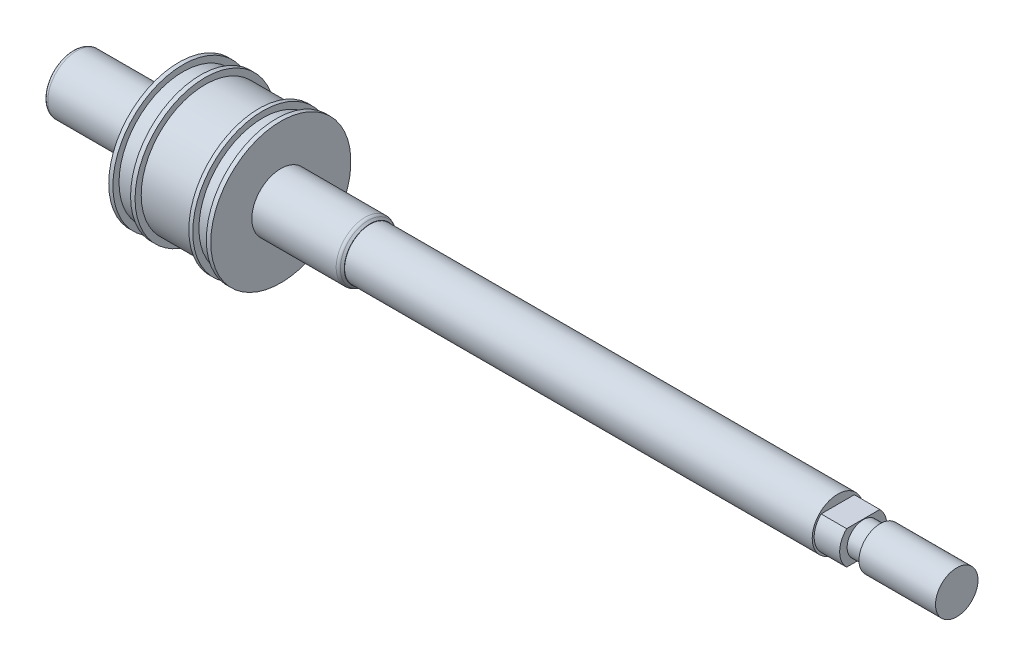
from build123d import *

# Parameters (mm, degrees)
SKETCH1_R      = 6
EXTRUDE1_DEPTH = 180
EXTRUDE2_DEPTH = 6
SKETCH3_R      = 3.788307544
EXTRUDE3_DEPTH = 4
SKETCH4_R      = 5
EXTRUDE4_DEPTH = 18
SKETCH8_R      = 6.825455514
EXTRUDE5_DEPTH = 70
CHAMFER1_SIZE  = 0.75
FILLET1_R      = 1
FILLET2_R      = 1
SKETCH9_R      = 16.479367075
EXTRUDE6_DEPTH = 24
SKETCH10_W     = 4.15677911
SKETCH10_H     = 1.813063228
SKETCH10_W_2   = 12.647221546
SKETCH10_W_3   = 3.183915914


with BuildPart() as part:
    # Sketch1 → Extrude1 (new body)
    with BuildSketch(Plane(origin=(0, 0, 0), x_dir=(0, 0, -1), z_dir=(1, 0, 0))):
        with Locations(Location((0, 0, 0), (0, 0, 180))):
            Circle(SKETCH1_R)
    extrude(amount=EXTRUDE1_DEPTH)

    # Sketch2 → Extrude2 (add)
    with BuildSketch(Plane(origin=(180, 0, 0), x_dir=(0, 0, -1), z_dir=(1, 0, 0))):
        with BuildLine():
            Line((-3.906170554, 3.923966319), (3.906170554, 3.923966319))
            ThreePointArc((3.906170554, 3.923966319), (5.53675718, 0), (3.906170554, -3.923966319))
            Line((3.906170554, -3.923966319), (-3.906170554, -3.923966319))
            ThreePointArc((-3.906170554, -3.923966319), (-5.53675718, 0), (-3.906170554, 3.923966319))
        make_face()
    extrude(amount=EXTRUDE2_DEPTH)

    # Sketch3 → Extrude3 (add)
    with BuildSketch(Plane(origin=(186, 0, 0), x_dir=(0, 0, -1), z_dir=(1, 0, 0))):
        Circle(SKETCH3_R)
    extrude(amount=EXTRUDE3_DEPTH)

    # Sketch4 → Extrude4 (add)
    with BuildSketch(Plane(origin=(190, 0, 0), x_dir=(0, 0, -1), z_dir=(1, 0, 0))):
        Circle(SKETCH4_R)
    extrude(amount=EXTRUDE4_DEPTH)

    # Sketch8 → Extrude5 (add)
    with BuildSketch(Plane.ZY):
        Circle(SKETCH8_R)
    extrude(amount=-EXTRUDE5_DEPTH)

    # Chamfer1
    chamfer1_edges = [part.edges().sort_by_distance(p)[0] for p in [
        (70, 0, -6.825455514),
    ]]
    chamfer(chamfer1_edges, length=CHAMFER1_SIZE)

    # Fillet1
    fillet1_edges = [part.edges().sort_by_distance(p)[0] for p in [
        (69.25, 0, -6.825455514),
    ]]
    fillet(fillet1_edges, radius=FILLET1_R)

    # Fillet2
    fillet2_edges = [part.edges().sort_by_distance(p)[0] for p in [
        (0, 0, -6.825455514),
    ]]
    fillet(fillet2_edges, radius=FILLET2_R)

    # Sketch9 → Extrude6 (add)
    with BuildSketch(Plane.ZY.offset(-25)):
        Circle(SKETCH9_R)
    extrude(amount=-EXTRUDE6_DEPTH)

    # Sketch10 → Cut-Revolve1 (revolve, cut)
    with BuildSketch(Plane(origin=(0, 0, 0), x_dir=(1, 0, 0), z_dir=(0, 1, 0)), mode=Mode.PRIVATE) as cut_revolve1_sk:
        with Locations((28.051356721, 15.941597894)):
            Rectangle(SKETCH10_W, SKETCH10_H)
        with Locations((37.514662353, 15.941597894)):
            Rectangle(SKETCH10_W_2, SKETCH10_H)
        with Locations((46.358873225, 15.941597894)):
            Rectangle(SKETCH10_W_3, SKETCH10_H)
    revolve(cut_revolve1_sk.sketch.rotate(Axis((0, 0, 0), (1, 0, 0)), 180), axis=Axis((0, 0, 0), (1, 0, 0)), mode=Mode.SUBTRACT)


solid = part.part
